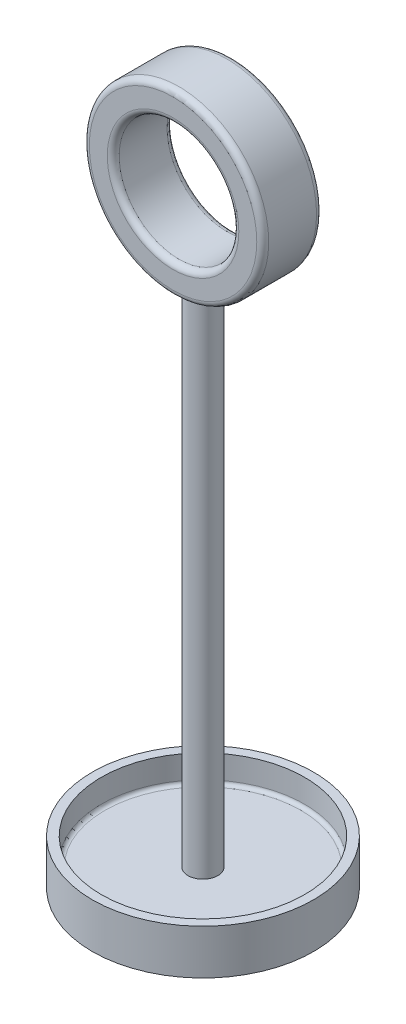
ISO-10303-21;
HEADER;
FILE_DESCRIPTION(('STEP AP214'),'2;1');
FILE_NAME('part.step','',(''),(''),'','','');
FILE_SCHEMA(('AUTOMOTIVE_DESIGN { 1 0 10303 214 1 1 1 1 }'));
ENDSEC;
DATA;
#1=APPLICATION_CONTEXT('core data for automotive mechanical design processes');
#2=APPLICATION_PROTOCOL_DEFINITION('international standard','automotive_design',2000,#1);
#3=PRODUCT_CONTEXT('',#1,'mechanical');
#4=PRODUCT('Part','Part','',(#3));
#5=PRODUCT_RELATED_PRODUCT_CATEGORY('part','',(#4));
#6=PRODUCT_DEFINITION_FORMATION('','',#4);
#7=PRODUCT_DEFINITION_CONTEXT('part definition',#1,'design');
#8=PRODUCT_DEFINITION('design','',#6,#7);
#9=PRODUCT_DEFINITION_SHAPE('','',#8);
#10=(LENGTH_UNIT() NAMED_UNIT(*) SI_UNIT(.MILLI.,.METRE.));
#11=(NAMED_UNIT(*) PLANE_ANGLE_UNIT() SI_UNIT($,.RADIAN.));
#12=(NAMED_UNIT(*) SI_UNIT($,.STERADIAN.) SOLID_ANGLE_UNIT());
#13=UNCERTAINTY_MEASURE_WITH_UNIT(LENGTH_MEASURE(1.E-05),#10,'distance_accuracy_value','');
#14=(GEOMETRIC_REPRESENTATION_CONTEXT(3) GLOBAL_UNCERTAINTY_ASSIGNED_CONTEXT((#13)) GLOBAL_UNIT_ASSIGNED_CONTEXT((#10,
#11,#12)) REPRESENTATION_CONTEXT('',''));
#15=CARTESIAN_POINT('',(0.,0.,0.));
#16=DIRECTION('',(0.,0.,1.));
#17=DIRECTION('',(1.,0.,0.));
#18=AXIS2_PLACEMENT_3D('',#15,#16,#17);
#19=CARTESIAN_POINT('',(0.,0.,-46.99));
#20=DIRECTION('',(0.,0.,1.));
#21=DIRECTION('',(1.,0.,0.));
#22=AXIS2_PLACEMENT_3D('',#19,#20,#21);
#23=CYLINDRICAL_SURFACE('',#22,25.4);
#24=DIRECTION('',(0.,0.,1.));
#25=VECTOR('',#24,1.);
#26=CARTESIAN_POINT('',(-18.2874513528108,17.6275104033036,-46.99));
#27=LINE('',#26,#25);
#28=CARTESIAN_POINT('',(-18.2874513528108,17.6275104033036,-10.16));
#29=VERTEX_POINT('',#28);
#30=CARTESIAN_POINT('',(-18.2874513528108,17.6275104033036,10.16));
#31=VERTEX_POINT('',#30);
#32=EDGE_CURVE('E12',#29,#31,#27,.T.);
#33=ORIENTED_EDGE('',*,*,#32,.F.);
#34=CARTESIAN_POINT('',(0.,0.,-10.16));
#35=DIRECTION('',(0.,0.,1.));
#36=DIRECTION('',(1.,0.,0.));
#37=AXIS2_PLACEMENT_3D('',#34,#35,#36);
#38=CIRCLE('',#37,25.4);
#39=CARTESIAN_POINT('',(18.2874513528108,17.6275104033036,-10.16));
#40=VERTEX_POINT('',#39);
#41=EDGE_CURVE('E71',#29,#40,#38,.F.);
#42=ORIENTED_EDGE('',*,*,#41,.T.);
#43=DIRECTION('',(0.,0.,1.));
#44=VECTOR('',#43,1.);
#45=CARTESIAN_POINT('',(18.2874513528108,17.6275104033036,-46.99));
#46=LINE('',#45,#44);
#47=CARTESIAN_POINT('',(18.2874513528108,17.6275104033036,10.16));
#48=VERTEX_POINT('',#47);
#49=EDGE_CURVE('E52',#48,#40,#46,.F.);
#50=ORIENTED_EDGE('',*,*,#49,.F.);
#51=CARTESIAN_POINT('',(0.,0.,10.16));
#52=DIRECTION('',(0.,0.,1.));
#53=DIRECTION('',(1.,0.,0.));
#54=AXIS2_PLACEMENT_3D('',#51,#52,#53);
#55=CIRCLE('',#54,25.4);
#56=EDGE_CURVE('E69',#48,#31,#55,.T.);
#57=ORIENTED_EDGE('',*,*,#56,.T.);
#58=EDGE_LOOP('',(#33,#42,#50,#57));
#59=FACE_BOUND('',#58,.T.);
#60=ADVANCED_FACE('F43',(#59),#23,.F.);
#61=CARTESIAN_POINT('',(0.,-279.580512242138,0.));
#62=DIRECTION('',(0.,1.,0.));
#63=DIRECTION('',(0.,0.,1.));
#64=AXIS2_PLACEMENT_3D('',#61,#62,#63);
#65=CYLINDRICAL_SURFACE('',#64,6.35);
#66=CARTESIAN_POINT('',(0.,-261.62,0.));
#67=DIRECTION('',(0.,-1.,0.));
#68=DIRECTION('',(0.,0.,-1.));
#69=AXIS2_PLACEMENT_3D('',#66,#67,#68);
#70=CIRCLE('',#69,6.35);
#71=CARTESIAN_POINT('',(0.,-261.62,-6.35));
#72=VERTEX_POINT('',#71);
#73=EDGE_CURVE('E73',#72,#72,#70,.T.);
#74=ORIENTED_EDGE('',*,*,#73,.F.);
#75=EDGE_LOOP('',(#74));
#76=FACE_BOUND('',#75,.T.);
#77=CARTESIAN_POINT('',(-2.13523160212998,-38.0401207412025,8.59329550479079));
#78=CARTESIAN_POINT('',(-1.4957202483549,-38.0760171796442,6.17282122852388));
#79=CARTESIAN_POINT('',(-1.62684312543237,-40.576128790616,6.13806821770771));
#80=CARTESIAN_POINT('',(-1.68408430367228,-38.0654427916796,8.72083930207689));
#81=CARTESIAN_POINT('',(-1.17403905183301,-38.0864461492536,6.25020854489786));
#82=CARTESIAN_POINT('',(-1.28311185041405,-40.603138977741,6.22917093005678));
#83=CARTESIAN_POINT('',(-1.22246188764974,-38.0832294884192,8.80796885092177));
#84=CARTESIAN_POINT('',(-0.851006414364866,-38.0934197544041,6.30155523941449));
#85=CARTESIAN_POINT('',(-0.931399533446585,-40.622111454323,6.29140632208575));
#86=CARTESIAN_POINT('',(-0.291741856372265,-38.1017243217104,8.89851833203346));
#87=CARTESIAN_POINT('',(-0.202020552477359,-38.1006938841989,6.35511063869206));
#88=CARTESIAN_POINT('',(-0.222279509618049,-40.641839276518,6.35608452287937));
#89=CARTESIAN_POINT('',(0.17735483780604,-38.102434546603,8.90194850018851));
#90=CARTESIAN_POINT('',(0.122611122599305,-38.1009655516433,6.3571068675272));
#91=CARTESIAN_POINT('',(0.135127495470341,-40.6425968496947,6.35853464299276));
#92=CARTESIAN_POINT('',(1.10062901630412,-38.0868483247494,8.82571951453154));
#93=CARTESIAN_POINT('',(0.765900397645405,-38.0948456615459,6.31205964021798));
#94=CARTESIAN_POINT('',(0.838574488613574,-40.6259715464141,6.30408536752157));
#95=CARTESIAN_POINT('',(1.55492257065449,-38.0708617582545,8.74757435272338));
#96=CARTESIAN_POINT('',(1.08327757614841,-38.0885996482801,6.2660873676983));
#97=CARTESIAN_POINT('',(1.18470291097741,-40.6089192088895,6.24826739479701));
#98=CARTESIAN_POINT('',(2.44457903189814,-38.0241051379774,8.51303084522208));
#99=CARTESIAN_POINT('',(1.71405910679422,-38.0695133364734,6.12464233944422));
#100=CARTESIAN_POINT('',(1.86253640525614,-40.5590454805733,6.0807363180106));
#101=CARTESIAN_POINT('',(2.87994133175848,-37.9933346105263,8.35662999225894));
#102=CARTESIAN_POINT('',(2.02640546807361,-38.0567417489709,6.02968223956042));
#103=CARTESIAN_POINT('',(2.19424101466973,-40.5262235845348,5.9690214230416));
#104=CARTESIAN_POINT('',(3.7220835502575,-37.920124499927,7.96931227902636));
#105=CARTESIAN_POINT('',(2.64232534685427,-38.0247602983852,5.78748761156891));
#106=CARTESIAN_POINT('',(2.83587318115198,-40.4481327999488,5.69236591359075));
#107=CARTESIAN_POINT('',(4.12870357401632,-37.8776252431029,7.73801327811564));
#108=CARTESIAN_POINT('',(2.94516922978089,-38.0056109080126,5.64072256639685));
#109=CARTESIAN_POINT('',(3.14567891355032,-40.4028002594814,5.52715234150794));
#110=CARTESIAN_POINT('',(4.90022200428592,-37.7855659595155,7.20772364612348));
#111=CARTESIAN_POINT('',(3.53132306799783,-37.9620275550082,5.29413147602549));
#112=CARTESIAN_POINT('',(3.73350247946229,-40.3046036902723,5.14837403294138));
#113=CARTESIAN_POINT('',(5.26511476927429,-37.7360049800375,6.90872387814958));
#114=CARTESIAN_POINT('',(3.81443129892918,-37.9376764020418,5.0950750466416));
#115=CARTESIAN_POINT('',(4.0115160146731,-40.2517386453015,4.93480277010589));
#116=CARTESIAN_POINT('',(5.95088803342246,-37.6340244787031,6.24412814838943));
#117=CARTESIAN_POINT('',(4.35579928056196,-37.8854458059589,4.64097369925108));
#118=CARTESIAN_POINT('',(4.53400993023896,-40.1429594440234,4.46009153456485));
#119=CARTESIAN_POINT('',(6.27068964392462,-37.581566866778,5.87727125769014));
#120=CARTESIAN_POINT('',(4.61377965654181,-37.857535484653,4.38541327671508));
#121=CARTESIAN_POINT('',(4.77766830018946,-40.0870046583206,4.1980508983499));
#122=CARTESIAN_POINT('',(6.84835466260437,-37.480611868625,5.09114869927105));
#123=CARTESIAN_POINT('',(5.08607964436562,-37.8020912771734,3.82607928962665));
#124=CARTESIAN_POINT('',(5.21779402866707,-39.979319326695,3.63653478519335));
#125=CARTESIAN_POINT('',(7.10621535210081,-37.4321146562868,4.67188073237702));
#126=CARTESIAN_POINT('',(5.30109492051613,-37.7745249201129,3.52251692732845));
#127=CARTESIAN_POINT('',(5.41425931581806,-39.9275889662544,3.33705766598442));
#128=CARTESIAN_POINT('',(7.55381614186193,-37.3443755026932,3.7898662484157));
#129=CARTESIAN_POINT('',(5.67746421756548,-37.7236217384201,2.87432718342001));
#130=CARTESIAN_POINT('',(5.75528848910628,-39.8340005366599,2.70704732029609));
#131=CARTESIAN_POINT('',(7.74319036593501,-37.305183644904,3.32690239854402));
#132=CARTESIAN_POINT('',(5.83941099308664,-37.7002155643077,2.52915588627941));
#133=CARTESIAN_POINT('',(5.89957361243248,-39.7921958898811,2.37635885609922));
#134=CARTESIAN_POINT('',(8.04597801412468,-37.2410581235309,2.37247122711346));
#135=CARTESIAN_POINT('',(6.09920172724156,-37.6615366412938,1.81125495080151));
#136=CARTESIAN_POINT('',(6.1302689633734,-39.7237953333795,1.6946223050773));
#137=CARTESIAN_POINT('',(8.15940288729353,-37.2161223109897,1.88100821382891));
#138=CARTESIAN_POINT('',(6.19782695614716,-37.6461566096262,1.43767778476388));
#139=CARTESIAN_POINT('',(6.21668791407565,-39.6971971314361,1.34357729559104));
#140=CARTESIAN_POINT('',(8.30511922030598,-37.1838744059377,0.89372414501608));
#141=CARTESIAN_POINT('',(6.32434369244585,-37.6262594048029,0.684883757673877));
#142=CARTESIAN_POINT('',(6.32770988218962,-39.6627993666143,0.63837438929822));
#143=CARTESIAN_POINT('',(8.33894128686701,-37.176229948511,0.39817239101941));
#144=CARTESIAN_POINT('',(6.35397829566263,-37.6214739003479,0.304766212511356));
#145=CARTESIAN_POINT('',(6.35347907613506,-39.6546452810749,0.284408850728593));
#146=CARTESIAN_POINT('',(8.32881869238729,-37.1784994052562,-0.591953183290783));
#147=CARTESIAN_POINT('',(6.34515813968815,-37.6228836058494,-0.453200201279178));
#148=CARTESIAN_POINT('',(6.34576662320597,-39.6570660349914,-0.422823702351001));
#149=CARTESIAN_POINT('',(8.28488054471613,-37.188411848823,-1.08652708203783));
#150=CARTESIAN_POINT('',(6.30667936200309,-37.6290826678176,-0.832326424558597));
#151=CARTESIAN_POINT('',(6.31228993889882,-39.667639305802,-0.776090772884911));
#152=CARTESIAN_POINT('',(8.12186006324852,-37.224348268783,-2.0535570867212));
#153=CARTESIAN_POINT('',(6.16529913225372,-37.6512094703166,-1.5687562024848));
#154=CARTESIAN_POINT('',(6.1880838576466,-39.7059714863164,-1.46682649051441));
#155=CARTESIAN_POINT('',(8.00382395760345,-37.2501478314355,-2.52622432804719));
#156=CARTESIAN_POINT('',(6.06285035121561,-37.6670700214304,-1.92739477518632));
#157=CARTESIAN_POINT('',(6.0981515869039,-39.7334910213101,-1.80444594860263));
#158=CARTESIAN_POINT('',(7.69723233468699,-37.3147020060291,-3.44368496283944));
#159=CARTESIAN_POINT('',(5.80019918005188,-37.7058932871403,-2.61625695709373));
#160=CARTESIAN_POINT('',(5.86455796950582,-39.8023488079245,-2.45977497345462));
#161=CARTESIAN_POINT('',(7.50867213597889,-37.353457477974,-3.88847650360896));
#162=CARTESIAN_POINT('',(5.63927681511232,-37.7289531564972,-2.94720684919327));
#163=CARTESIAN_POINT('',(5.72089305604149,-39.8436879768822,-2.77748321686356));
#164=CARTESIAN_POINT('',(7.06347740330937,-37.44020844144,-4.74425939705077));
#165=CARTESIAN_POINT('',(5.26546465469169,-37.779139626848,-3.57507096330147));
#166=CARTESIAN_POINT('',(5.38169706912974,-39.9362223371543,-3.3887567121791));
#167=CARTESIAN_POINT('',(6.80595648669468,-37.4883218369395,-5.15471211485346));
#168=CARTESIAN_POINT('',(5.05110760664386,-37.8063971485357,-3.87169541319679));
#169=CARTESIAN_POINT('',(5.18549065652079,-39.9875432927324,-3.68193722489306));
#170=CARTESIAN_POINT('',(6.23109603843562,-37.5881409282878,-5.92438069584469));
#171=CARTESIAN_POINT('',(4.5818025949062,-37.8610564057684,-4.418377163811));
#172=CARTESIAN_POINT('',(4.74750174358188,-40.0940169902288,-4.23170049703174));
#173=CARTESIAN_POINT('',(5.91374057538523,-37.6398475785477,-6.28358286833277));
#174=CARTESIAN_POINT('',(4.32619077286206,-37.8884859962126,-4.66819493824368));
#175=CARTESIAN_POINT('',(4.50570710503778,-40.1491707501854,-4.48827347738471));
#176=CARTESIAN_POINT('',(5.22068309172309,-37.742276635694,-6.94789679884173));
#177=CARTESIAN_POINT('',(3.77962543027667,-37.9408256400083,-5.12155272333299));
#178=CARTESIAN_POINT('',(3.97766330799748,-40.2584284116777,-4.96278342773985));
#179=CARTESIAN_POINT('',(4.84393778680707,-37.7929584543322,-7.2517781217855));
#180=CARTESIAN_POINT('',(3.48783646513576,-37.9656272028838,-5.32337226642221));
#181=CARTESIAN_POINT('',(3.69061926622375,-40.3124890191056,-5.17984151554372));
#182=CARTESIAN_POINT('',(4.04725911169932,-37.8865408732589,-7.78761078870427));
#183=CARTESIAN_POINT('',(2.88399037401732,-38.0097190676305,-5.67265081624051));
#184=CARTESIAN_POINT('',(3.08362598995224,-40.4123102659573,-5.5625791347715));
#185=CARTESIAN_POINT('',(3.62735766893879,-37.9294471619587,-8.01961480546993));
#186=CARTESIAN_POINT('',(2.57219385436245,-38.0289214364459,-5.81930777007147));
#187=CARTESIAN_POINT('',(2.76370108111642,-40.4580769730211,-5.72829628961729));
#188=CARTESIAN_POINT('',(2.84804243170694,-37.9949726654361,-8.36426705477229));
#189=CARTESIAN_POINT('',(2.00439305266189,-38.0573358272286,-6.03386817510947));
#190=CARTESIAN_POINT('',(2.16993709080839,-40.5279708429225,-5.97447646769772));
#191=CARTESIAN_POINT('',(2.49452804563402,-38.0199616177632,-8.4917643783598));
#192=CARTESIAN_POINT('',(1.75051482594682,-38.0677636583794,-6.11156128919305));
#193=CARTESIAN_POINT('',(1.90059279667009,-40.5546257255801,-6.06554598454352));
#194=CARTESIAN_POINT('',(1.77418583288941,-38.0603780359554,-8.69532107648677));
#195=CARTESIAN_POINT('',(1.23846006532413,-38.0843505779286,-6.2346740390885));
#196=CARTESIAN_POINT('',(1.35176063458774,-40.5977365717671,-6.21094362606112));
#197=CARTESIAN_POINT('',(1.40735878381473,-38.075806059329,-8.77138345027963));
#198=CARTESIAN_POINT('',(0.980833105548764,-38.0904709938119,-6.27980384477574));
#199=CARTESIAN_POINT('',(1.07227335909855,-40.6141931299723,-6.26527389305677));
#200=CARTESIAN_POINT('',(0.580991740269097,-38.0982946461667,-8.88190474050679));
#201=CARTESIAN_POINT('',(0.403036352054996,-38.0993726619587,-6.34540443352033));
#202=CARTESIAN_POINT('',(0.442660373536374,-40.6381809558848,-6.34421767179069));
#203=CARTESIAN_POINT('',(0.119698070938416,-38.1025812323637,-8.90260614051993));
#204=CARTESIAN_POINT('',(0.0835434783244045,-38.1010121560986,-6.3574476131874));
#205=CARTESIAN_POINT('',(0.0911985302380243,-40.6427533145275,-6.35900438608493));
#206=CARTESIAN_POINT('',(-0.799804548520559,-38.0943836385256,-8.86258811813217));
#207=CARTESIAN_POINT('',(-0.556156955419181,-38.0978034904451,-6.33383619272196));
#208=CARTESIAN_POINT('',(-0.609374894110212,-40.6340092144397,-6.3304200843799));
#209=CARTESIAN_POINT('',(-1.25801151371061,-38.0818895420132,-8.80182055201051));
#210=CARTESIAN_POINT('',(-0.875077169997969,-38.0929643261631,-6.29824777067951));
#211=CARTESIAN_POINT('',(-0.958484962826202,-40.6206821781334,-6.28701468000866));
#212=CARTESIAN_POINT('',(-2.15777607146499,-38.0415128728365,-8.60085908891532));
#213=CARTESIAN_POINT('',(-1.5097350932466,-38.0766705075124,-6.17778507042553));
#214=CARTESIAN_POINT('',(-1.64401986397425,-40.5776137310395,-6.1434707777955));
#215=CARTESIAN_POINT('',(-2.59934578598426,-38.0136417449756,-8.46072426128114));
#216=CARTESIAN_POINT('',(-1.82434704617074,-38.0652816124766,-6.09339903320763));
#217=CARTESIAN_POINT('',(-1.98045393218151,-40.547884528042,-6.04337447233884));
#218=CARTESIAN_POINT('',(-3.45400452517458,-37.9455377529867,-8.10540841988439));
#219=CARTESIAN_POINT('',(-2.44476217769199,-38.0360080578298,-5.873144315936));
#220=CARTESIAN_POINT('',(-2.63162249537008,-40.4752402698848,-5.78957744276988));
#221=CARTESIAN_POINT('',(-3.8670939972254,-37.9053050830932,-7.89022858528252));
#222=CARTESIAN_POINT('',(-2.74978639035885,-38.0182145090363,-5.73798166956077));
#223=CARTESIAN_POINT('',(-2.94635733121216,-40.4323254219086,-5.63587756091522));
#224=CARTESIAN_POINT('',(-4.65819431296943,-37.8162868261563,-7.38832251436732));
#225=CARTESIAN_POINT('',(-3.34571445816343,-37.9768114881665,-5.41316926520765));
#226=CARTESIAN_POINT('',(-3.54910042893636,-40.3373726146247,-5.27737322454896));
#227=CARTESIAN_POINT('',(-5.03577833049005,-37.767413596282,-7.10084898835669));
#228=CARTESIAN_POINT('',(-3.63614701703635,-37.9532300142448,-5.2237329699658));
#229=CARTESIAN_POINT('',(-3.83678348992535,-40.2852411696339,-5.07203499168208));
#230=CARTESIAN_POINT('',(-5.7409290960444,-37.6666806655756,-6.46343576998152));
#231=CARTESIAN_POINT('',(-4.1885367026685,-37.902443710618,-4.79207999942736));
#232=CARTESIAN_POINT('',(-4.37404121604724,-40.1777927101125,-4.61673983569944));
#233=CARTESIAN_POINT('',(-6.0684893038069,-37.6148205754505,-6.11348792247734));
#234=CARTESIAN_POINT('',(-4.450686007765,-37.8752880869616,-4.55051709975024));
#235=CARTESIAN_POINT('',(-4.62361089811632,-40.1224752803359,-4.36677708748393));
#236=CARTESIAN_POINT('',(-6.67045966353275,-37.5127989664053,-5.35337601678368));
#237=CARTESIAN_POINT('',(-4.93934427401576,-37.8200400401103,-4.01413593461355));
#238=CARTESIAN_POINT('',(-5.08225498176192,-40.0136522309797,-3.82384001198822));
#239=CARTESIAN_POINT('',(-6.94378324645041,-37.4626861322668,-4.9422241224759));
#240=CARTESIAN_POINT('',(-5.16579148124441,-37.7919170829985,-3.71868763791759));
#241=CARTESIAN_POINT('',(-5.29050152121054,-39.9601985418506,-3.53016008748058));
#242=CARTESIAN_POINT('',(-7.42181564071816,-37.3709264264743,-4.07579723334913));
#243=CARTESIAN_POINT('',(-5.5656298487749,-37.7392264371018,-3.08582065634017));
#244=CARTESIAN_POINT('',(-5.65471667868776,-39.8623215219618,-2.91128373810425));
#245=CARTESIAN_POINT('',(-7.62652728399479,-37.329279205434,-3.62052406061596));
#246=CARTESIAN_POINT('',(-5.73988558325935,-37.7145766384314,-2.74819986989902));
#247=CARTESIAN_POINT('',(-5.81068745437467,-39.8178978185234,-2.58608861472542));
#248=CARTESIAN_POINT('',(-7.96009606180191,-37.2595749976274,-2.68133750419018));
#249=CARTESIAN_POINT('',(-6.02507866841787,-37.6728176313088,-2.04463987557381));
#250=CARTESIAN_POINT('',(-6.06483509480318,-39.7435466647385,-1.91524107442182));
#251=CARTESIAN_POINT('',(-8.0893963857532,-37.2314387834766,-2.19761023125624));
#252=CARTESIAN_POINT('',(-6.1371841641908,-37.6555593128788,-1.6781574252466));
#253=CARTESIAN_POINT('',(-6.16334962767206,-39.713534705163,-1.56972159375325));
#254=CARTESIAN_POINT('',(-8.26978748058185,-37.1917908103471,-1.21311039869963));
#255=CARTESIAN_POINT('',(-6.2935075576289,-37.6311842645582,-0.929101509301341));
#256=CARTESIAN_POINT('',(-6.30079046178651,-39.6712435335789,-0.866507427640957));
#257=CARTESIAN_POINT('',(-8.32089097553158,-37.1802763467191,-0.712340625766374));
#258=CARTESIAN_POINT('',(-6.33824862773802,-37.6239877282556,-0.545382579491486));
#259=CARTESIAN_POINT('',(-6.33972645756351,-39.6589614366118,-0.508814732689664));
#260=CARTESIAN_POINT('',(-8.34294117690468,-37.1753333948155,0.280336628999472));
#261=CARTESIAN_POINT('',(-6.35746201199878,-37.6209172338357,0.214484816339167));
#262=CARTESIAN_POINT('',(-6.35652661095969,-39.6536889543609,0.200240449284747));
#263=CARTESIAN_POINT('',(-8.31561142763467,-37.1815160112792,0.772199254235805));
#264=CARTESIAN_POINT('',(-6.33351009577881,-37.6247894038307,0.591869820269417));
#265=CARTESIAN_POINT('',(-6.33570394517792,-39.6602837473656,0.551570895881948));
#266=CARTESIAN_POINT('',(-8.18540171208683,-37.2103959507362,1.74382117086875));
#267=CARTESIAN_POINT('',(-6.22039299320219,-37.6426285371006,1.33321936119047));
#268=CARTESIAN_POINT('',(-6.2364965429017,-39.6910890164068,1.24558655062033));
#269=CARTESIAN_POINT('',(-8.08252247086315,-37.2330931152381,2.22358057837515));
#270=CARTESIAN_POINT('',(-6.13086466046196,-37.6566522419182,1.69833566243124));
#271=CARTESIAN_POINT('',(-6.15811235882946,-39.715299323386,1.58827184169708));
#272=CARTESIAN_POINT('',(-7.80493974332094,-37.2922619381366,3.15603438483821));
#273=CARTESIAN_POINT('',(-5.89228968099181,-37.692459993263,2.40109094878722));
#274=CARTESIAN_POINT('',(-5.94662075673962,-39.7784127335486,2.2543102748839));
#275=CARTESIAN_POINT('',(-7.63047074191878,-37.3286885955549,3.60881166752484));
#276=CARTESIAN_POINT('',(-5.7427567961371,-37.7143140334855,2.73964589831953));
#277=CARTESIAN_POINT('',(-5.81369199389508,-39.8172678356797,2.57772261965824));
#278=CARTESIAN_POINT('',(-7.21486341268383,-37.4112341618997,4.47700576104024));
#279=CARTESIAN_POINT('',(-5.39210241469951,-37.7625188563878,3.38016842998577));
#280=CARTESIAN_POINT('',(-5.49703879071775,-39.9053164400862,3.19786125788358));
#281=CARTESIAN_POINT('',(-6.97371680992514,-37.4573542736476,4.89241792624));
#282=CARTESIAN_POINT('',(-5.19017666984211,-37.7889581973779,3.68249596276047));
#283=CARTESIAN_POINT('',(-5.3133080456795,-39.954511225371,3.49458423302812));
#284=CARTESIAN_POINT('',(-6.42580885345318,-37.5552628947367,5.68319474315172));
#285=CARTESIAN_POINT('',(-4.73980371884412,-37.843292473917,4.24860951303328));
#286=CARTESIAN_POINT('',(-4.89585436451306,-40.0589470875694,4.0594248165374));
#287=CARTESIAN_POINT('',(-6.11781111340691,-37.6071477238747,6.0575713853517));
#288=CARTESIAN_POINT('',(-4.4898163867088,-37.8712433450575,4.51130039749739));
#289=CARTESIAN_POINT('',(-4.66118941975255,-40.1142909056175,4.32683670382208));
#290=CARTESIAN_POINT('',(-5.44753659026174,-37.7100663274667,6.74642617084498));
#291=CARTESIAN_POINT('',(-3.95718338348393,-37.9246524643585,4.98557171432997));
#292=CARTESIAN_POINT('',(-4.15050406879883,-40.2240707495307,4.81887583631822));
#293=CARTESIAN_POINT('',(-5.08525500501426,-37.7611000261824,7.06089900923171));
#294=CARTESIAN_POINT('',(-3.67415630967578,-37.95008403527,5.19658907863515));
#295=CARTESIAN_POINT('',(-3.87448000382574,-40.278506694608,5.04349929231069));
#296=CARTESIAN_POINT('',(-4.31115656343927,-37.8573333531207,7.62484698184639));
#297=CARTESIAN_POINT('',(-3.08225507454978,-37.9962513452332,5.56793317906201));
#298=CARTESIAN_POINT('',(-3.28469071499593,-40.3811555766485,5.44631927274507));
#299=CARTESIAN_POINT('',(-3.89877782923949,-37.9024522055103,7.87346177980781));
#300=CARTESIAN_POINT('',(-2.77326873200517,-38.0168370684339,5.72674765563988));
#301=CARTESIAN_POINT('',(-2.97049739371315,-40.4292823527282,5.62390127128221));
#302=CARTESIAN_POINT('',(-3.03959939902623,-37.9810039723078,8.29300198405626));
#303=CARTESIAN_POINT('',(-2.14181019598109,-38.0515144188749,5.99059357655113));
#304=CARTESIAN_POINT('',(-2.315885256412,-40.5130709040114,5.92357284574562));
#305=CARTESIAN_POINT('',(-2.59280328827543,-38.0144381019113,8.46393546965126));
#306=CARTESIAN_POINT('',(-1.82002300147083,-38.0655032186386,6.09480324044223));
#307=CARTESIAN_POINT('',(-1.97546917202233,-40.5487339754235,6.04566819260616));
#308=CARTESIAN_POINT('',(-2.13523160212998,-38.0401207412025,8.59329550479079));
#309=CARTESIAN_POINT('',(-1.4957202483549,-38.0760171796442,6.17282122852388));
#310=CARTESIAN_POINT('',(-1.62684312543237,-40.576128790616,6.13806821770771));
#311=(BOUNDED_SURFACE() B_SPLINE_SURFACE(3,2,((#77,#78,#79),(#80,#81,#82),(#83,#84,#85),(#86,
#87,#88),(#89,#90,#91),(#92,#93,#94),(#95,#96,#97),(#98,#99,#100),(#101,#102,#103),(#104,#105,
#106),(#107,#108,#109),(#110,#111,#112),(#113,#114,#115),(#116,#117,#118),(#119,#120,#121),
(#122,#123,#124),(#125,#126,#127),(#128,#129,#130),(#131,#132,#133),(#134,#135,#136),(#137,#138,
#139),(#140,#141,#142),(#143,#144,#145),(#146,#147,#148),(#149,#150,#151),(#152,#153,#154),
(#155,#156,#157),(#158,#159,#160),(#161,#162,#163),(#164,#165,#166),(#167,#168,#169),(#170,#171,
#172),(#173,#174,#175),(#176,#177,#178),(#179,#180,#181),(#182,#183,#184),(#185,#186,#187),
(#188,#189,#190),(#191,#192,#193),(#194,#195,#196),(#197,#198,#199),(#200,#201,#202),(#203,#204,
#205),(#206,#207,#208),(#209,#210,#211),(#212,#213,#214),(#215,#216,#217),(#218,#219,#220),
(#221,#222,#223),(#224,#225,#226),(#227,#228,#229),(#230,#231,#232),(#233,#234,#235),(#236,#237,
#238),(#239,#240,#241),(#242,#243,#244),(#245,#246,#247),(#248,#249,#250),(#251,#252,#253),
(#254,#255,#256),(#257,#258,#259),(#260,#261,#262),(#263,#264,#265),(#266,#267,#268),(#269,#270,
#271),(#272,#273,#274),(#275,#276,#277),(#278,#279,#280),(#281,#282,#283),(#284,#285,#286),
(#287,#288,#289),(#290,#291,#292),(#293,#294,#295),(#296,#297,#298),(#299,#300,#301),(#302,#303,
#304),(#305,#306,#307),(#308,#309,#310)),.UNSPECIFIED.,.T.,.F.,
.F.) B_SPLINE_SURFACE_WITH_KNOTS((4,2,2,2,2,2,2,2,2,2,2,2,2,2,2,2,2,2,2,2,2,2,2,2,2,2,2,2,2,2,2,
2,2,2,2,2,2,2,4),(3,3),(0.,1.49388668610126,2.98759067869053,4.45405700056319,5.92057031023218,
7.39468708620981,8.86900292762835,10.3741231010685,11.8793093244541,13.3924219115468,
14.9053063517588,16.3888544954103,17.8722783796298,19.3352140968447,20.7982469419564,
22.2810712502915,23.7642909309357,25.2772821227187,26.7891619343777,27.9824517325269,
29.1756719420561,30.6458981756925,32.1169936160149,33.5869956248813,35.0569745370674,
36.5428223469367,38.0288642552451,39.542197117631,41.0554675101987,42.5597524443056,
44.0637925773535,45.5350366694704,47.0062666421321,48.4727157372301,49.9393469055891,
51.4358500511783,52.9324856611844,54.4478030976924,55.9629628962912),(0.,1.),
.UNSPECIFIED.) GEOMETRIC_REPRESENTATION_ITEM() RATIONAL_B_SPLINE_SURFACE(((1.,0.712164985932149,
1.),(1.,0.710035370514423,1.),(1.,0.708528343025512,1.),(1.,0.706961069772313,1.),(1.,
0.706900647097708,1.),(1.,0.708221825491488,1.),(1.,0.709577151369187,1.),(1.,0.713513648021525,
1.),(1.,0.716094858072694,1.),(1.,0.722179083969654,1.),(1.,0.725686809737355,1.),(1.,
0.733204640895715,1.),(1.,0.737214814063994,1.),(1.,0.745378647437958,1.),(1.,0.749533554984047,
1.),(1.,0.757451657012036,1.),(1.,0.761214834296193,1.),(1.,0.767970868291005,1.),(1.,
0.770959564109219,1.),(1.,0.775826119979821,1.),(1.,0.777704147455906,1.),(1.,0.780129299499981,
1.),(1.,0.78070152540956,1.),(1.,0.780531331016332,1.),(1.,0.779789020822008,1.),(1.,
0.777084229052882,1.),(1.,0.775138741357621,1.),(1.,0.770234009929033,1.),(1.,0.767274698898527,
1.),(1.,0.760587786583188,1.),(1.,0.75685033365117,1.),(1.,0.749014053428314,1.),(1.,
0.744915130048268,1.),(1.,0.736709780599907,1.),(1.,0.73260485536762,1.),(1.,0.724954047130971,
1.),(1.,0.721407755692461,1.),(1.,0.715955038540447,1.),(1.,0.713860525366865,1.),(1.,
0.710461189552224,1.),(1.,0.709156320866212,1.),(1.,0.707252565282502,1.),(1.,0.706887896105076,
1.),(1.,0.707583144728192,1.),(1.,0.708643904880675,1.),(1.,0.712050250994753,1.),(1.,
0.714394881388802,1.),(1.,0.720073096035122,1.),(1.,0.723406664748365,1.),(1.,0.730705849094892,
1.),(1.,0.734677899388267,1.),(1.,0.742776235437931,1.),(1.,0.746902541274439,1.),(1.,
0.754939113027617,1.),(1.,0.758844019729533,1.),(1.,0.765935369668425,1.),(1.,0.769121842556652,
1.),(1.,0.774425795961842,1.),(1.,0.776549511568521,1.),(1.,0.779535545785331,1.),(1.,
0.780398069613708,1.),(1.,0.780768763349,1.),(1.,0.780306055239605,1.),(1.,0.778135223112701,
1.),(1.,0.776427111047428,1.),(1.,0.771942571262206,1.),(1.,0.769169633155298,1.),(1.,
0.762828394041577,1.),(1.,0.759259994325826,1.),(1.,0.751606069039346,1.),(1.,0.747511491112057,
1.),(1.,0.73930222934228,1.),(1.,0.735187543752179,1.),(1.,0.727353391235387,1.),(1.,
0.723639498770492,1.),(1.,0.717125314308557,1.),(1.,0.714324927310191,1.),(1.,0.712164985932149,1.))) REPRESENTATION_ITEM('') SURFACE());
#312=CARTESIAN_POINT('',(-1.62684312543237,-40.576128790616,6.13806821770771));
#313=CARTESIAN_POINT('',(-1.97546917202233,-40.5487339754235,6.04566819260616));
#314=CARTESIAN_POINT('',(-2.315885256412,-40.5130709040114,5.92357284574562));
#315=CARTESIAN_POINT('',(-2.97049739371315,-40.4292823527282,5.62390127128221));
#316=CARTESIAN_POINT('',(-3.28469071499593,-40.3811555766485,5.44631927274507));
#317=CARTESIAN_POINT('',(-3.87448000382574,-40.278506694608,5.04349929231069));
#318=CARTESIAN_POINT('',(-4.15050406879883,-40.2240707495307,4.81887583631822));
#319=CARTESIAN_POINT('',(-4.66118941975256,-40.1142909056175,4.32683670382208));
#320=CARTESIAN_POINT('',(-4.89585436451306,-40.0589470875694,4.0594248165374));
#321=CARTESIAN_POINT('',(-5.3133080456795,-39.954511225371,3.49458423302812));
#322=CARTESIAN_POINT('',(-5.49703879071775,-39.9053164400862,3.19786125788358));
#323=CARTESIAN_POINT('',(-5.81369199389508,-39.8172678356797,2.57772261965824));
#324=CARTESIAN_POINT('',(-5.94662075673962,-39.7784127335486,2.2543102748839));
#325=CARTESIAN_POINT('',(-6.15811235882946,-39.7152993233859,1.58827184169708));
#326=CARTESIAN_POINT('',(-6.2364965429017,-39.6910890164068,1.24558655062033));
#327=CARTESIAN_POINT('',(-6.33570394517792,-39.6602837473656,0.551570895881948));
#328=CARTESIAN_POINT('',(-6.35652661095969,-39.6536889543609,0.200240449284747));
#329=CARTESIAN_POINT('',(-6.33972645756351,-39.6589614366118,-0.508814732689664));
#330=CARTESIAN_POINT('',(-6.30079046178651,-39.6712435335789,-0.866507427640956));
#331=CARTESIAN_POINT('',(-6.16334962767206,-39.713534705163,-1.56972159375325));
#332=CARTESIAN_POINT('',(-6.06483509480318,-39.7435466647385,-1.91524107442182));
#333=CARTESIAN_POINT('',(-5.81068745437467,-39.8178978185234,-2.58608861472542));
#334=CARTESIAN_POINT('',(-5.65471667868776,-39.8623215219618,-2.91128373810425));
#335=CARTESIAN_POINT('',(-5.29050152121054,-39.9601985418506,-3.53016008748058));
#336=CARTESIAN_POINT('',(-5.08225498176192,-40.0136522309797,-3.82384001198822));
#337=CARTESIAN_POINT('',(-4.62361089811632,-40.1224752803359,-4.36677708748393));
#338=CARTESIAN_POINT('',(-4.37404121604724,-40.1777927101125,-4.61673983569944));
#339=CARTESIAN_POINT('',(-3.83678348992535,-40.2852411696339,-5.07203499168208));
#340=CARTESIAN_POINT('',(-3.54910042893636,-40.3373726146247,-5.27737322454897));
#341=CARTESIAN_POINT('',(-2.94635733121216,-40.4323254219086,-5.63587756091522));
#342=CARTESIAN_POINT('',(-2.63162249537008,-40.4752402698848,-5.78957744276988));
#343=CARTESIAN_POINT('',(-1.98045393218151,-40.547884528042,-6.04337447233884));
#344=CARTESIAN_POINT('',(-1.64401986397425,-40.5776137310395,-6.1434707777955));
#345=CARTESIAN_POINT('',(-0.958484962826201,-40.6206821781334,-6.28701468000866));
#346=CARTESIAN_POINT('',(-0.609374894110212,-40.6340092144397,-6.3304200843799));
#347=CARTESIAN_POINT('',(0.0911985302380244,-40.6427533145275,-6.35900438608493));
#348=CARTESIAN_POINT('',(0.442660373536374,-40.6381809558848,-6.34421767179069));
#349=CARTESIAN_POINT('',(1.07227335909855,-40.6141931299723,-6.26527389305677));
#350=CARTESIAN_POINT('',(1.35176063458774,-40.5977365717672,-6.21094362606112));
#351=CARTESIAN_POINT('',(1.90059279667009,-40.5546257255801,-6.06554598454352));
#352=CARTESIAN_POINT('',(2.16993709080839,-40.5279708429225,-5.97447646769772));
#353=CARTESIAN_POINT('',(2.76370108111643,-40.4580769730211,-5.72829628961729));
#354=CARTESIAN_POINT('',(3.08362598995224,-40.4123102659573,-5.5625791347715));
#355=CARTESIAN_POINT('',(3.69061926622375,-40.3124890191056,-5.17984151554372));
#356=CARTESIAN_POINT('',(3.97766330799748,-40.2584284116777,-4.96278342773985));
#357=CARTESIAN_POINT('',(4.50570710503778,-40.1491707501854,-4.48827347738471));
#358=CARTESIAN_POINT('',(4.74750174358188,-40.0940169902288,-4.23170049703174));
#359=CARTESIAN_POINT('',(5.18549065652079,-39.9875432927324,-3.68193722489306));
#360=CARTESIAN_POINT('',(5.38169706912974,-39.9362223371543,-3.3887567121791));
#361=CARTESIAN_POINT('',(5.72089305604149,-39.8436879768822,-2.77748321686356));
#362=CARTESIAN_POINT('',(5.86455796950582,-39.8023488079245,-2.45977497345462));
#363=CARTESIAN_POINT('',(6.0981515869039,-39.7334910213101,-1.80444594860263));
#364=CARTESIAN_POINT('',(6.1880838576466,-39.7059714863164,-1.46682649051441));
#365=CARTESIAN_POINT('',(6.31228993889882,-39.667639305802,-0.776090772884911));
#366=CARTESIAN_POINT('',(6.34576662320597,-39.6570660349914,-0.422823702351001));
#367=CARTESIAN_POINT('',(6.35347907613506,-39.6546452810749,0.284408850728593));
#368=CARTESIAN_POINT('',(6.32770988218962,-39.6627993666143,0.63837438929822));
#369=CARTESIAN_POINT('',(6.21668791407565,-39.6971971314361,1.34357729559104));
#370=CARTESIAN_POINT('',(6.1302689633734,-39.7237953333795,1.6946223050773));
#371=CARTESIAN_POINT('',(5.89957361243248,-39.7921958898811,2.37635885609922));
#372=CARTESIAN_POINT('',(5.75528848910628,-39.8340005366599,2.70704732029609));
#373=CARTESIAN_POINT('',(5.41425931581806,-39.9275889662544,3.33705766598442));
#374=CARTESIAN_POINT('',(5.21779402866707,-39.979319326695,3.63653478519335));
#375=CARTESIAN_POINT('',(4.77766830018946,-40.0870046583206,4.1980508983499));
#376=CARTESIAN_POINT('',(4.53400993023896,-40.1429594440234,4.46009153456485));
#377=CARTESIAN_POINT('',(4.0115160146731,-40.2517386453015,4.93480277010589));
#378=CARTESIAN_POINT('',(3.73350247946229,-40.3046036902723,5.14837403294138));
#379=CARTESIAN_POINT('',(3.14567891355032,-40.4028002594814,5.52715234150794));
#380=CARTESIAN_POINT('',(2.83587318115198,-40.4481327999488,5.69236591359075));
#381=CARTESIAN_POINT('',(2.19424101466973,-40.5262235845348,5.9690214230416));
#382=CARTESIAN_POINT('',(1.86253640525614,-40.5590454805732,6.0807363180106));
#383=CARTESIAN_POINT('',(1.18470291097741,-40.6089192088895,6.24826739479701));
#384=CARTESIAN_POINT('',(0.838574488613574,-40.6259715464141,6.30408536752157));
#385=CARTESIAN_POINT('',(0.135127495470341,-40.6425968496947,6.35853464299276));
#386=CARTESIAN_POINT('',(-0.222279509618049,-40.641839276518,6.35608452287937));
#387=CARTESIAN_POINT('',(-0.931399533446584,-40.622111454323,6.29140632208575));
#388=CARTESIAN_POINT('',(-1.28311185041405,-40.603138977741,6.22917093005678));
#389=CARTESIAN_POINT('',(-1.62684312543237,-40.576128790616,6.13806821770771));
#390=B_SPLINE_CURVE_WITH_KNOTS('',3,(#312,#313,#314,#315,#316,#317,#318,#319,#320,#321,#322,
#323,#324,#325,#326,#327,#328,#329,#330,#331,#332,#333,#334,#335,#336,#337,#338,#339,#340,#341,
#342,#343,#344,#345,#346,#347,#348,#349,#350,#351,#352,#353,#354,#355,#356,#357,#358,#359,#360,
#361,#362,#363,#364,#365,#366,#367,#368,#369,#370,#371,#372,#373,#374,#375,#376,#377,#378,#379,
#380,#381,#382,#383,#384,#385,#386,#387,#388,#389),.UNSPECIFIED.,.T.,.F.,(4,2,2,2,2,2,2,2,2,2,2,
2,2,2,2,2,2,2,2,2,2,2,2,2,2,2,2,2,2,2,2,2,2,2,2,2,2,2,4),(0.,1.51515979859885,3.03047723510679,
4.52711284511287,6.02361599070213,7.49024715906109,8.95669625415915,10.4279262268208,
11.8991703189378,13.4032104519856,14.9074953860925,16.4207657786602,17.9340986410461,
19.4201405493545,20.9059883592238,22.3759672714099,23.8459692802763,25.3170647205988,
26.7872909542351,27.9805111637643,29.1738009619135,30.6856807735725,32.1986719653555,
33.6818916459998,35.1647159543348,36.6277487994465,38.0906845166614,39.574108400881,
41.0576565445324,42.5705409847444,44.0836535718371,45.5888397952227,47.0939599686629,
48.5682758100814,50.042392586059,51.508905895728,52.9753722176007,54.4690762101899,
55.9629628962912),.UNSPECIFIED.);
#391=CARTESIAN_POINT('',(-1.62684312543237,-40.576128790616,6.13806821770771));
#392=VERTEX_POINT('',#391);
#393=EDGE_CURVE('E96',#392,#392,#390,.T.);
#394=ORIENTED_EDGE('',*,*,#393,.T.);
#395=EDGE_LOOP('',(#394));
#396=FACE_BOUND('',#395,.T.);
#397=ADVANCED_FACE('F45',(#76,#396),#65,.T.);
#398=CARTESIAN_POINT('',(0.,-261.62,0.));
#399=DIRECTION('',(0.,-1.,0.));
#400=DIRECTION('',(0.,0.,-1.));
#401=AXIS2_PLACEMENT_3D('',#398,#399,#400);
#402=PLANE('',#401);
#403=CARTESIAN_POINT('',(0.,-261.62,0.));
#404=DIRECTION('',(0.,-1.,0.));
#405=DIRECTION('',(0.,0.,-1.));
#406=AXIS2_PLACEMENT_3D('',#403,#404,#405);
#407=CIRCLE('',#406,12.7);
#408=CARTESIAN_POINT('',(0.,-261.62,-12.7));
#409=VERTEX_POINT('',#408);
#410=EDGE_CURVE('E305',#409,#409,#407,.T.);
#411=ORIENTED_EDGE('',*,*,#410,.F.);
#412=EDGE_LOOP('',(#411));
#413=FACE_BOUND('',#412,.T.);
#414=ORIENTED_EDGE('',*,*,#73,.T.);
#415=EDGE_LOOP('',(#414));
#416=FACE_BOUND('',#415,.T.);
#417=ADVANCED_FACE('F136',(#413,#416),#402,.F.);
#418=CARTESIAN_POINT('',(0.,-267.97,0.));
#419=DIRECTION('',(0.,1.,0.));
#420=DIRECTION('',(0.,0.,1.));
#421=AXIS2_PLACEMENT_3D('',#418,#419,#420);
#422=CYLINDRICAL_SURFACE('',#421,12.7);
#423=CARTESIAN_POINT('',(0.,-267.97,0.));
#424=DIRECTION('',(0.,-1.,0.));
#425=DIRECTION('',(0.,0.,-1.));
#426=AXIS2_PLACEMENT_3D('',#423,#424,#425);
#427=CIRCLE('',#426,12.7);
#428=CARTESIAN_POINT('',(0.,-267.97,-12.7));
#429=VERTEX_POINT('',#428);
#430=EDGE_CURVE('E127',#429,#429,#427,.T.);
#431=ORIENTED_EDGE('',*,*,#430,.F.);
#432=EDGE_LOOP('',(#431));
#433=FACE_BOUND('',#432,.T.);
#434=ORIENTED_EDGE('',*,*,#410,.T.);
#435=EDGE_LOOP('',(#434));
#436=FACE_BOUND('',#435,.T.);
#437=ADVANCED_FACE('F134',(#433,#436),#422,.T.);
#438=CARTESIAN_POINT('',(0.,-267.97,0.));
#439=DIRECTION('',(0.,-1.,0.));
#440=DIRECTION('',(0.,0.,-1.));
#441=AXIS2_PLACEMENT_3D('',#438,#439,#440);
#442=PLANE('',#441);
#443=ORIENTED_EDGE('',*,*,#430,.T.);
#444=EDGE_LOOP('',(#443));
#445=FACE_BOUND('',#444,.T.);
#446=ADVANCED_FACE('F131',(#445),#442,.T.);
#447=CARTESIAN_POINT('',(0.,0.,12.7));
#448=DIRECTION('',(0.,0.,-1.));
#449=DIRECTION('',(-1.,0.,0.));
#450=AXIS2_PLACEMENT_3D('',#447,#448,#449);
#451=CYLINDRICAL_SURFACE('',#450,38.1);
#452=CARTESIAN_POINT('',(-2.13523160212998,-38.0401207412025,8.59329550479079));
#453=CARTESIAN_POINT('',(-1.68408430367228,-38.0654427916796,8.72083930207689));
#454=CARTESIAN_POINT('',(-1.22246188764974,-38.0832294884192,8.80796885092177));
#455=CARTESIAN_POINT('',(-0.291741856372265,-38.1017243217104,8.89851833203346));
#456=CARTESIAN_POINT('',(0.17735483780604,-38.102434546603,8.90194850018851));
#457=CARTESIAN_POINT('',(1.10062901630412,-38.0868483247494,8.82571951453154));
#458=CARTESIAN_POINT('',(1.55492257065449,-38.0708617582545,8.74757435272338));
#459=CARTESIAN_POINT('',(2.44457903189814,-38.0241051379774,8.51303084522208));
#460=CARTESIAN_POINT('',(2.87994133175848,-37.9933346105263,8.35662999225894));
#461=CARTESIAN_POINT('',(3.7220835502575,-37.920124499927,7.96931227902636));
#462=CARTESIAN_POINT('',(4.12870357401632,-37.8776252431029,7.73801327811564));
#463=CARTESIAN_POINT('',(4.90022200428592,-37.7855659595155,7.20772364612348));
#464=CARTESIAN_POINT('',(5.26511476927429,-37.7360049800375,6.90872387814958));
#465=CARTESIAN_POINT('',(5.95088803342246,-37.6340244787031,6.24412814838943));
#466=CARTESIAN_POINT('',(6.27068964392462,-37.581566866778,5.87727125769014));
#467=CARTESIAN_POINT('',(6.84835466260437,-37.480611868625,5.09114869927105));
#468=CARTESIAN_POINT('',(7.10621535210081,-37.4321146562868,4.67188073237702));
#469=CARTESIAN_POINT('',(7.55381614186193,-37.3443755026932,3.7898662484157));
#470=CARTESIAN_POINT('',(7.74319036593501,-37.305183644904,3.32690239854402));
#471=CARTESIAN_POINT('',(8.04597801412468,-37.2410581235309,2.37247122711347));
#472=CARTESIAN_POINT('',(8.15940288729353,-37.2161223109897,1.88100821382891));
#473=CARTESIAN_POINT('',(8.30511922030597,-37.1838744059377,0.893724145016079));
#474=CARTESIAN_POINT('',(8.33894128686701,-37.176229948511,0.398172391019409));
#475=CARTESIAN_POINT('',(8.32881869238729,-37.1784994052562,-0.591953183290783));
#476=CARTESIAN_POINT('',(8.28488054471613,-37.188411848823,-1.08652708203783));
#477=CARTESIAN_POINT('',(8.12186006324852,-37.224348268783,-2.0535570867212));
#478=CARTESIAN_POINT('',(8.00382395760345,-37.2501478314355,-2.5262243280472));
#479=CARTESIAN_POINT('',(7.69723233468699,-37.3147020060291,-3.44368496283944));
#480=CARTESIAN_POINT('',(7.50867213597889,-37.353457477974,-3.88847650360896));
#481=CARTESIAN_POINT('',(7.06347740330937,-37.44020844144,-4.74425939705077));
#482=CARTESIAN_POINT('',(6.80595648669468,-37.4883218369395,-5.15471211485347));
#483=CARTESIAN_POINT('',(6.23109603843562,-37.5881409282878,-5.92438069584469));
#484=CARTESIAN_POINT('',(5.91374057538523,-37.6398475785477,-6.28358286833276));
#485=CARTESIAN_POINT('',(5.22068309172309,-37.742276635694,-6.94789679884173));
#486=CARTESIAN_POINT('',(4.84393778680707,-37.7929584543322,-7.2517781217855));
#487=CARTESIAN_POINT('',(4.04725911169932,-37.8865408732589,-7.78761078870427));
#488=CARTESIAN_POINT('',(3.62735766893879,-37.9294471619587,-8.01961480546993));
#489=CARTESIAN_POINT('',(2.84804243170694,-37.9949726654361,-8.36426705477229));
#490=CARTESIAN_POINT('',(2.49452804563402,-38.0199616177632,-8.4917643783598));
#491=CARTESIAN_POINT('',(1.7741858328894,-38.0603780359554,-8.69532107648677));
#492=CARTESIAN_POINT('',(1.40735878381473,-38.075806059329,-8.77138345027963));
#493=CARTESIAN_POINT('',(0.580991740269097,-38.0982946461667,-8.88190474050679));
#494=CARTESIAN_POINT('',(0.119698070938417,-38.1025812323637,-8.90260614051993));
#495=CARTESIAN_POINT('',(-0.799804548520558,-38.0943836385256,-8.86258811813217));
#496=CARTESIAN_POINT('',(-1.25801151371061,-38.0818895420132,-8.80182055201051));
#497=CARTESIAN_POINT('',(-2.15777607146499,-38.0415128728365,-8.60085908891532));
#498=CARTESIAN_POINT('',(-2.59934578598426,-38.0136417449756,-8.46072426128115));
#499=CARTESIAN_POINT('',(-3.45400452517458,-37.9455377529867,-8.10540841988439));
#500=CARTESIAN_POINT('',(-3.8670939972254,-37.9053050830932,-7.89022858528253));
#501=CARTESIAN_POINT('',(-4.65819431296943,-37.8162868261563,-7.38832251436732));
#502=CARTESIAN_POINT('',(-5.03577833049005,-37.767413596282,-7.10084898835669));
#503=CARTESIAN_POINT('',(-5.7409290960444,-37.6666806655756,-6.46343576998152));
#504=CARTESIAN_POINT('',(-6.0684893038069,-37.6148205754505,-6.11348792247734));
#505=CARTESIAN_POINT('',(-6.67045966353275,-37.5127989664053,-5.35337601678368));
#506=CARTESIAN_POINT('',(-6.94378324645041,-37.4626861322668,-4.9422241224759));
#507=CARTESIAN_POINT('',(-7.42181564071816,-37.3709264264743,-4.07579723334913));
#508=CARTESIAN_POINT('',(-7.62652728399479,-37.329279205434,-3.62052406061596));
#509=CARTESIAN_POINT('',(-7.96009606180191,-37.2595749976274,-2.68133750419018));
#510=CARTESIAN_POINT('',(-8.0893963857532,-37.2314387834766,-2.19761023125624));
#511=CARTESIAN_POINT('',(-8.26978748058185,-37.1917908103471,-1.21311039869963));
#512=CARTESIAN_POINT('',(-8.32089097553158,-37.1802763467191,-0.712340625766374));
#513=CARTESIAN_POINT('',(-8.34294117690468,-37.1753333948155,0.280336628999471));
#514=CARTESIAN_POINT('',(-8.31561142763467,-37.1815160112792,0.772199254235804));
#515=CARTESIAN_POINT('',(-8.18540171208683,-37.2103959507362,1.74382117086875));
#516=CARTESIAN_POINT('',(-8.08252247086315,-37.2330931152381,2.22358057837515));
#517=CARTESIAN_POINT('',(-7.80493974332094,-37.2922619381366,3.15603438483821));
#518=CARTESIAN_POINT('',(-7.63047074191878,-37.3286885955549,3.60881166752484));
#519=CARTESIAN_POINT('',(-7.21486341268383,-37.4112341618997,4.47700576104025));
#520=CARTESIAN_POINT('',(-6.97371680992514,-37.4573542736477,4.89241792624));
#521=CARTESIAN_POINT('',(-6.42580885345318,-37.5552628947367,5.68319474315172));
#522=CARTESIAN_POINT('',(-6.11781111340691,-37.6071477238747,6.0575713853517));
#523=CARTESIAN_POINT('',(-5.44753659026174,-37.7100663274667,6.74642617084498));
#524=CARTESIAN_POINT('',(-5.08525500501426,-37.7611000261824,7.06089900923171));
#525=CARTESIAN_POINT('',(-4.31115656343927,-37.8573333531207,7.62484698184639));
#526=CARTESIAN_POINT('',(-3.89877782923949,-37.9024522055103,7.87346177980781));
#527=CARTESIAN_POINT('',(-3.03959939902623,-37.9810039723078,8.29300198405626));
#528=CARTESIAN_POINT('',(-2.59280328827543,-38.0144381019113,8.46393546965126));
#529=CARTESIAN_POINT('',(-2.13523160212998,-38.0401207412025,8.59329550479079));
#530=B_SPLINE_CURVE_WITH_KNOTS('',3,(#452,#453,#454,#455,#456,#457,#458,#459,#460,#461,#462,
#463,#464,#465,#466,#467,#468,#469,#470,#471,#472,#473,#474,#475,#476,#477,#478,#479,#480,#481,
#482,#483,#484,#485,#486,#487,#488,#489,#490,#491,#492,#493,#494,#495,#496,#497,#498,#499,#500,
#501,#502,#503,#504,#505,#506,#507,#508,#509,#510,#511,#512,#513,#514,#515,#516,#517,#518,#519,
#520,#521,#522,#523,#524,#525,#526,#527,#528,#529),.UNSPECIFIED.,.T.,.F.,(4,2,2,2,2,2,2,2,2,2,2,
2,2,2,2,2,2,2,2,2,2,2,2,2,2,2,2,2,2,2,2,2,2,2,2,2,2,2,4),(0.,1.49388668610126,2.98759067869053,
4.45405700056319,5.92057031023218,7.39468708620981,8.86900292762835,10.3741231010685,
11.8793093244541,13.3924219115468,14.9053063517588,16.3888544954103,17.8722783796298,
19.3352140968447,20.7982469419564,22.2810712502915,23.7642909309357,25.2772821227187,
26.7891619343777,27.9824517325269,29.1756719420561,30.6458981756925,32.1169936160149,
33.5869956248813,35.0569745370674,36.5428223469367,38.0288642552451,39.542197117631,
41.0554675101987,42.5597524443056,44.0637925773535,45.5350366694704,47.0062666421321,
48.4727157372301,49.9393469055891,51.4358500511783,52.9324856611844,54.4478030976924,
55.9629628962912),.UNSPECIFIED.);
#531=CARTESIAN_POINT('',(-2.13523160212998,-38.0401207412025,8.59329550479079));
#532=VERTEX_POINT('',#531);
#533=EDGE_CURVE('E89',#532,#532,#530,.T.);
#534=ORIENTED_EDGE('',*,*,#533,.T.);
#535=EDGE_LOOP('',(#534));
#536=FACE_BOUND('',#535,.T.);
#537=CARTESIAN_POINT('',(0.,0.,10.16));
#538=DIRECTION('',(0.,0.,1.));
#539=DIRECTION('',(1.,0.,0.));
#540=AXIS2_PLACEMENT_3D('',#537,#538,#539);
#541=CIRCLE('',#540,38.1);
#542=CARTESIAN_POINT('',(38.1,0.,10.16));
#543=VERTEX_POINT('',#542);
#544=EDGE_CURVE('E176',#543,#543,#541,.F.);
#545=ORIENTED_EDGE('',*,*,#544,.T.);
#546=EDGE_LOOP('',(#545));
#547=FACE_BOUND('',#546,.T.);
#548=CARTESIAN_POINT('',(0.,0.,-10.16));
#549=DIRECTION('',(0.,0.,1.));
#550=DIRECTION('',(1.,0.,0.));
#551=AXIS2_PLACEMENT_3D('',#548,#549,#550);
#552=CIRCLE('',#551,38.1);
#553=CARTESIAN_POINT('',(38.1,0.,-10.16));
#554=VERTEX_POINT('',#553);
#555=EDGE_CURVE('E178',#554,#554,#552,.T.);
#556=ORIENTED_EDGE('',*,*,#555,.T.);
#557=EDGE_LOOP('',(#556));
#558=FACE_BOUND('',#557,.T.);
#559=ADVANCED_FACE('F102',(#536,#547,#558),#451,.T.);
#560=CARTESIAN_POINT('',(0.,0.,12.7));
#561=DIRECTION('',(0.,0.,1.));
#562=DIRECTION('',(1.,0.,0.));
#563=AXIS2_PLACEMENT_3D('',#560,#561,#562);
#564=PLANE('',#563);
#565=CARTESIAN_POINT('',(0.,0.,12.7));
#566=DIRECTION('',(0.,0.,1.));
#567=DIRECTION('',(1.,0.,0.));
#568=AXIS2_PLACEMENT_3D('',#565,#566,#567);
#569=CIRCLE('',#568,35.56);
#570=CARTESIAN_POINT('',(35.56,0.,12.7));
#571=VERTEX_POINT('',#570);
#572=EDGE_CURVE('E182',#571,#571,#569,.T.);
#573=ORIENTED_EDGE('',*,*,#572,.T.);
#574=EDGE_LOOP('',(#573));
#575=FACE_BOUND('',#574,.T.);
#576=CARTESIAN_POINT('',(0.,0.,12.7));
#577=DIRECTION('',(0.,0.,1.));
#578=DIRECTION('',(1.,0.,0.));
#579=AXIS2_PLACEMENT_3D('',#576,#577,#578);
#580=CIRCLE('',#579,27.94);
#581=CARTESIAN_POINT('',(27.94,0.,12.7));
#582=VERTEX_POINT('',#581);
#583=EDGE_CURVE('E187',#582,#582,#580,.F.);
#584=ORIENTED_EDGE('',*,*,#583,.T.);
#585=EDGE_LOOP('',(#584));
#586=FACE_BOUND('',#585,.T.);
#587=ADVANCED_FACE('F158',(#575,#586),#564,.T.);
#588=CARTESIAN_POINT('',(0.,0.,-12.7));
#589=DIRECTION('',(0.,0.,1.));
#590=DIRECTION('',(1.,0.,0.));
#591=AXIS2_PLACEMENT_3D('',#588,#589,#590);
#592=PLANE('',#591);
#593=CARTESIAN_POINT('',(0.,0.,-12.7));
#594=DIRECTION('',(0.,0.,1.));
#595=DIRECTION('',(1.,0.,0.));
#596=AXIS2_PLACEMENT_3D('',#593,#594,#595);
#597=CIRCLE('',#596,35.56);
#598=CARTESIAN_POINT('',(35.56,0.,-12.7));
#599=VERTEX_POINT('',#598);
#600=EDGE_CURVE('E82',#599,#599,#597,.F.);
#601=ORIENTED_EDGE('',*,*,#600,.T.);
#602=EDGE_LOOP('',(#601));
#603=FACE_BOUND('',#602,.T.);
#604=CARTESIAN_POINT('',(0.,0.,-12.7));
#605=DIRECTION('',(0.,0.,1.));
#606=DIRECTION('',(1.,0.,0.));
#607=AXIS2_PLACEMENT_3D('',#604,#605,#606);
#608=CIRCLE('',#607,27.94);
#609=CARTESIAN_POINT('',(27.94,0.,-12.7));
#610=VERTEX_POINT('',#609);
#611=EDGE_CURVE('E80',#610,#610,#608,.T.);
#612=ORIENTED_EDGE('',*,*,#611,.T.);
#613=EDGE_LOOP('',(#612));
#614=FACE_BOUND('',#613,.T.);
#615=ADVANCED_FACE('F152',(#603,#614),#592,.F.);
#616=EDGE_CURVE('E175',#40,#29,#38,.F.);
#617=ORIENTED_EDGE('',*,*,#616,.T.);
#618=ORIENTED_EDGE('',*,*,#32,.T.);
#619=EDGE_CURVE('E75',#31,#48,#55,.T.);
#620=ORIENTED_EDGE('',*,*,#619,.T.);
#621=ORIENTED_EDGE('',*,*,#49,.T.);
#622=EDGE_LOOP('',(#617,#618,#620,#621));
#623=FACE_BOUND('',#622,.T.);
#624=ADVANCED_FACE('F76',(#623),#23,.F.);
#625=CARTESIAN_POINT('',(0.,0.,10.16));
#626=DIRECTION('',(0.,0.,1.));
#627=DIRECTION('',(1.,0.,0.));
#628=AXIS2_PLACEMENT_3D('',#625,#626,#627);
#629=TOROIDAL_SURFACE('',#628,35.56,2.54);
#630=ORIENTED_EDGE('',*,*,#544,.F.);
#631=EDGE_LOOP('',(#630));
#632=FACE_BOUND('',#631,.T.);
#633=ORIENTED_EDGE('',*,*,#572,.F.);
#634=EDGE_LOOP('',(#633));
#635=FACE_BOUND('',#634,.T.);
#636=ADVANCED_FACE('F151',(#632,#635),#629,.T.);
#637=CARTESIAN_POINT('',(0.,0.,10.16));
#638=DIRECTION('',(0.,0.,1.));
#639=DIRECTION('',(1.,0.,0.));
#640=AXIS2_PLACEMENT_3D('',#637,#638,#639);
#641=TOROIDAL_SURFACE('',#640,27.94,2.54);
#642=ORIENTED_EDGE('',*,*,#583,.F.);
#643=EDGE_LOOP('',(#642));
#644=FACE_BOUND('',#643,.T.);
#645=ORIENTED_EDGE('',*,*,#56,.F.);
#646=ORIENTED_EDGE('',*,*,#619,.F.);
#647=EDGE_LOOP('',(#645,#646));
#648=FACE_BOUND('',#647,.T.);
#649=ADVANCED_FACE('F79',(#644,#648),#641,.T.);
#650=CARTESIAN_POINT('',(0.,0.,-10.16));
#651=DIRECTION('',(0.,0.,1.));
#652=DIRECTION('',(1.,0.,0.));
#653=AXIS2_PLACEMENT_3D('',#650,#651,#652);
#654=TOROIDAL_SURFACE('',#653,35.56,2.54);
#655=ORIENTED_EDGE('',*,*,#600,.F.);
#656=EDGE_LOOP('',(#655));
#657=FACE_BOUND('',#656,.T.);
#658=ORIENTED_EDGE('',*,*,#555,.F.);
#659=EDGE_LOOP('',(#658));
#660=FACE_BOUND('',#659,.T.);
#661=ADVANCED_FACE('F169',(#657,#660),#654,.T.);
#662=CARTESIAN_POINT('',(0.,0.,-10.16));
#663=DIRECTION('',(0.,0.,1.));
#664=DIRECTION('',(1.,0.,0.));
#665=AXIS2_PLACEMENT_3D('',#662,#663,#664);
#666=TOROIDAL_SURFACE('',#665,27.94,2.54);
#667=ORIENTED_EDGE('',*,*,#41,.F.);
#668=ORIENTED_EDGE('',*,*,#616,.F.);
#669=EDGE_LOOP('',(#667,#668));
#670=FACE_BOUND('',#669,.T.);
#671=ORIENTED_EDGE('',*,*,#611,.F.);
#672=EDGE_LOOP('',(#671));
#673=FACE_BOUND('',#672,.T.);
#674=ADVANCED_FACE('F109',(#670,#673),#666,.T.);
#675=CARTESIAN_POINT('',(-2.27758037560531,-40.576128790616,8.59329550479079));
#676=DIRECTION('',(0.965205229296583,-0.0541779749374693,0.255819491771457));
#677=DIRECTION('',(0.256195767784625,0.,-0.966624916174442));
#678=AXIS2_PLACEMENT_3D('',#675,#676,#677);
#679=CIRCLE('',#678,2.54);
#680=EDGE_CURVE('',#392,#532,#679,.T.);
#681=ORIENTED_EDGE('',*,*,#393,.F.);
#682=ORIENTED_EDGE('',*,*,#533,.F.);
#683=ORIENTED_EDGE('',*,*,#680,.T.);
#684=ORIENTED_EDGE('',*,*,#680,.F.);
#685=EDGE_LOOP('',(#681,#683,#682,#684));
#686=FACE_BOUND('',#685,.T.);
#687=ADVANCED_FACE('F112',(#686),#311,.F.);
#688=CLOSED_SHELL('',(#60,#397,#417,#437,#446,#559,#587,#615,#624,#636,#649,#661,#674,#687));
#689=MANIFOLD_SOLID_BREP('B2',#688);
#690=CARTESIAN_POINT('',(0.,-242.57,46.99));
#691=DIRECTION('',(0.,1.,0.));
#692=DIRECTION('',(0.,0.,1.));
#693=AXIS2_PLACEMENT_3D('',#690,#691,#692);
#694=PLANE('',#693);
#695=CARTESIAN_POINT('',(0.,-242.57,0.));
#696=DIRECTION('',(0.,1.,0.));
#697=DIRECTION('',(0.,0.,1.));
#698=AXIS2_PLACEMENT_3D('',#695,#696,#697);
#699=CIRCLE('',#698,46.99);
#700=CARTESIAN_POINT('',(0.,-242.57,46.99));
#701=VERTEX_POINT('',#700);
#702=EDGE_CURVE('E331',#701,#701,#699,.T.);
#703=ORIENTED_EDGE('',*,*,#702,.T.);
#704=EDGE_LOOP('',(#703));
#705=FACE_BOUND('',#704,.T.);
#706=CARTESIAN_POINT('',(0.,-242.57,0.));
#707=DIRECTION('',(0.,1.,0.));
#708=DIRECTION('',(0.,0.,1.));
#709=AXIS2_PLACEMENT_3D('',#706,#707,#708);
#710=CIRCLE('',#709,43.18);
#711=CARTESIAN_POINT('',(0.,-242.57,43.18));
#712=VERTEX_POINT('',#711);
#713=EDGE_CURVE('E340',#712,#712,#710,.T.);
#714=ORIENTED_EDGE('',*,*,#713,.F.);
#715=EDGE_LOOP('',(#714));
#716=FACE_BOUND('',#715,.T.);
#717=ADVANCED_FACE('F320',(#705,#716),#694,.T.);
#718=CARTESIAN_POINT('',(0.,-177.235139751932,0.));
#719=DIRECTION('',(0.,1.,0.));
#720=DIRECTION('',(0.,0.,1.));
#721=AXIS2_PLACEMENT_3D('',#718,#719,#720);
#722=CYLINDRICAL_SURFACE('',#721,46.99);
#723=CARTESIAN_POINT('',(0.,-261.62,0.));
#724=DIRECTION('',(0.,1.,0.));
#725=DIRECTION('',(0.,0.,1.));
#726=AXIS2_PLACEMENT_3D('',#723,#724,#725);
#727=CIRCLE('',#726,46.99);
#728=CARTESIAN_POINT('',(0.,-261.62,46.99));
#729=VERTEX_POINT('',#728);
#730=EDGE_CURVE('E335',#729,#729,#727,.T.);
#731=ORIENTED_EDGE('',*,*,#730,.T.);
#732=EDGE_LOOP('',(#731));
#733=FACE_BOUND('',#732,.T.);
#734=ORIENTED_EDGE('',*,*,#702,.F.);
#735=EDGE_LOOP('',(#734));
#736=FACE_BOUND('',#735,.T.);
#737=ADVANCED_FACE('F368',(#733,#736),#722,.T.);
#738=CARTESIAN_POINT('',(0.,-261.62,0.));
#739=DIRECTION('',(0.,-1.,0.));
#740=DIRECTION('',(0.,0.,-1.));
#741=AXIS2_PLACEMENT_3D('',#738,#739,#740);
#742=PLANE('',#741);
#743=CARTESIAN_POINT('',(0.,-261.62,0.));
#744=DIRECTION('',(0.,1.,0.));
#745=DIRECTION('',(0.,0.,1.));
#746=AXIS2_PLACEMENT_3D('',#743,#744,#745);
#747=CIRCLE('',#746,6.35);
#748=CARTESIAN_POINT('',(0.,-261.62,6.35));
#749=VERTEX_POINT('',#748);
#750=EDGE_CURVE('E343',#749,#749,#747,.T.);
#751=ORIENTED_EDGE('',*,*,#750,.T.);
#752=EDGE_LOOP('',(#751));
#753=FACE_BOUND('',#752,.T.);
#754=ORIENTED_EDGE('',*,*,#730,.F.);
#755=EDGE_LOOP('',(#754));
#756=FACE_BOUND('',#755,.T.);
#757=ADVANCED_FACE('F350',(#753,#756),#742,.T.);
#758=CARTESIAN_POINT('',(0.,-254.,43.18));
#759=DIRECTION('',(0.,1.,0.));
#760=DIRECTION('',(0.,0.,1.));
#761=AXIS2_PLACEMENT_3D('',#758,#759,#760);
#762=PLANE('',#761);
#763=CARTESIAN_POINT('',(0.,-254.,0.));
#764=DIRECTION('',(0.,1.,0.));
#765=DIRECTION('',(0.,0.,1.));
#766=AXIS2_PLACEMENT_3D('',#763,#764,#765);
#767=CIRCLE('',#766,6.35);
#768=CARTESIAN_POINT('',(0.,-254.,6.35));
#769=VERTEX_POINT('',#768);
#770=EDGE_CURVE('E344',#769,#769,#767,.T.);
#771=ORIENTED_EDGE('',*,*,#770,.F.);
#772=EDGE_LOOP('',(#771));
#773=FACE_BOUND('',#772,.T.);
#774=CARTESIAN_POINT('',(0.,-254.,0.));
#775=DIRECTION('',(0.,1.,0.));
#776=DIRECTION('',(0.,0.,1.));
#777=AXIS2_PLACEMENT_3D('',#774,#775,#776);
#778=CIRCLE('',#777,41.656);
#779=CARTESIAN_POINT('',(0.,-254.,41.656));
#780=VERTEX_POINT('',#779);
#781=EDGE_CURVE('E327',#780,#780,#778,.T.);
#782=ORIENTED_EDGE('',*,*,#781,.T.);
#783=EDGE_LOOP('',(#782));
#784=FACE_BOUND('',#783,.T.);
#785=ADVANCED_FACE('F359',(#773,#784),#762,.T.);
#786=CARTESIAN_POINT('',(0.,-177.235139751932,0.));
#787=DIRECTION('',(0.,1.,0.));
#788=DIRECTION('',(0.,0.,1.));
#789=AXIS2_PLACEMENT_3D('',#786,#787,#788);
#790=CYLINDRICAL_SURFACE('',#789,43.18);
#791=CARTESIAN_POINT('',(0.,-252.476,0.));
#792=DIRECTION('',(0.,1.,0.));
#793=DIRECTION('',(0.,0.,1.));
#794=AXIS2_PLACEMENT_3D('',#791,#792,#793);
#795=CIRCLE('',#794,43.18);
#796=CARTESIAN_POINT('',(0.,-252.476,43.18));
#797=VERTEX_POINT('',#796);
#798=EDGE_CURVE('E42',#797,#797,#795,.F.);
#799=ORIENTED_EDGE('',*,*,#798,.T.);
#800=EDGE_LOOP('',(#799));
#801=FACE_BOUND('',#800,.T.);
#802=ORIENTED_EDGE('',*,*,#713,.T.);
#803=EDGE_LOOP('',(#802));
#804=FACE_BOUND('',#803,.T.);
#805=ADVANCED_FACE('F361',(#801,#804),#790,.F.);
#806=CARTESIAN_POINT('',(0.,-252.476,0.));
#807=DIRECTION('',(0.,1.,0.));
#808=DIRECTION('',(0.,0.,1.));
#809=AXIS2_PLACEMENT_3D('',#806,#807,#808);
#810=TOROIDAL_SURFACE('',#809,41.656,1.524);
#811=ORIENTED_EDGE('',*,*,#798,.F.);
#812=EDGE_LOOP('',(#811));
#813=FACE_BOUND('',#812,.T.);
#814=ORIENTED_EDGE('',*,*,#781,.F.);
#815=EDGE_LOOP('',(#814));
#816=FACE_BOUND('',#815,.T.);
#817=ADVANCED_FACE('F322',(#813,#816),#810,.F.);
#818=CARTESIAN_POINT('',(0.,-261.62,0.));
#819=DIRECTION('',(0.,1.,0.));
#820=DIRECTION('',(0.,0.,1.));
#821=AXIS2_PLACEMENT_3D('',#818,#819,#820);
#822=CYLINDRICAL_SURFACE('',#821,6.35);
#823=CARTESIAN_POINT('',(0.,-261.62,6.35));
#824=CARTESIAN_POINT('',(0.,-261.540625,6.35));
#825=CARTESIAN_POINT('',(0.,-261.46125,6.35));
#826=CARTESIAN_POINT('',(0.,-261.3025,6.35));
#827=CARTESIAN_POINT('',(0.,-261.223125,6.35));
#828=CARTESIAN_POINT('',(0.,-261.064375,6.35));
#829=CARTESIAN_POINT('',(0.,-260.985,6.35));
#830=CARTESIAN_POINT('',(0.,-260.82625,6.35));
#831=CARTESIAN_POINT('',(0.,-260.746875,6.35));
#832=CARTESIAN_POINT('',(0.,-260.588125,6.35));
#833=CARTESIAN_POINT('',(0.,-260.50875,6.35));
#834=CARTESIAN_POINT('',(0.,-260.35,6.35));
#835=CARTESIAN_POINT('',(0.,-260.270625,6.35));
#836=CARTESIAN_POINT('',(0.,-260.111875,6.35));
#837=CARTESIAN_POINT('',(0.,-260.0325,6.35));
#838=CARTESIAN_POINT('',(0.,-259.87375,6.35));
#839=CARTESIAN_POINT('',(0.,-259.794375,6.35));
#840=CARTESIAN_POINT('',(0.,-259.635625,6.35));
#841=CARTESIAN_POINT('',(0.,-259.55625,6.35));
#842=CARTESIAN_POINT('',(0.,-259.3975,6.35));
#843=CARTESIAN_POINT('',(0.,-259.318125,6.35));
#844=CARTESIAN_POINT('',(0.,-259.159375,6.35));
#845=CARTESIAN_POINT('',(0.,-259.08,6.35));
#846=CARTESIAN_POINT('',(0.,-258.92125,6.35));
#847=CARTESIAN_POINT('',(0.,-258.841875,6.35));
#848=CARTESIAN_POINT('',(0.,-258.683125,6.35));
#849=CARTESIAN_POINT('',(0.,-258.60375,6.35));
#850=CARTESIAN_POINT('',(0.,-258.445,6.35));
#851=CARTESIAN_POINT('',(0.,-258.365625,6.35));
#852=CARTESIAN_POINT('',(0.,-258.206875,6.35));
#853=CARTESIAN_POINT('',(0.,-258.1275,6.35));
#854=CARTESIAN_POINT('',(0.,-257.96875,6.35));
#855=CARTESIAN_POINT('',(0.,-257.889375,6.35));
#856=CARTESIAN_POINT('',(0.,-257.730625,6.35));
#857=CARTESIAN_POINT('',(0.,-257.65125,6.35));
#858=CARTESIAN_POINT('',(0.,-257.4925,6.35));
#859=CARTESIAN_POINT('',(0.,-257.413125,6.35));
#860=CARTESIAN_POINT('',(0.,-257.254375,6.35));
#861=CARTESIAN_POINT('',(0.,-257.175,6.35));
#862=CARTESIAN_POINT('',(0.,-257.01625,6.35));
#863=CARTESIAN_POINT('',(0.,-256.936875,6.35));
#864=CARTESIAN_POINT('',(0.,-256.778125,6.35));
#865=CARTESIAN_POINT('',(0.,-256.69875,6.35));
#866=CARTESIAN_POINT('',(0.,-256.54,6.35));
#867=CARTESIAN_POINT('',(0.,-256.460625,6.35));
#868=CARTESIAN_POINT('',(0.,-256.301875,6.35));
#869=CARTESIAN_POINT('',(0.,-256.2225,6.35));
#870=CARTESIAN_POINT('',(0.,-256.06375,6.35));
#871=CARTESIAN_POINT('',(0.,-255.984375,6.35));
#872=CARTESIAN_POINT('',(0.,-255.825625,6.35));
#873=CARTESIAN_POINT('',(0.,-255.74625,6.35));
#874=CARTESIAN_POINT('',(0.,-255.5875,6.35));
#875=CARTESIAN_POINT('',(0.,-255.508125,6.35));
#876=CARTESIAN_POINT('',(0.,-255.349375,6.35));
#877=CARTESIAN_POINT('',(0.,-255.27,6.35));
#878=CARTESIAN_POINT('',(0.,-255.11125,6.35));
#879=CARTESIAN_POINT('',(0.,-255.031875,6.35));
#880=CARTESIAN_POINT('',(0.,-254.873125,6.35));
#881=CARTESIAN_POINT('',(0.,-254.79375,6.35));
#882=CARTESIAN_POINT('',(0.,-254.635,6.35));
#883=CARTESIAN_POINT('',(0.,-254.555625,6.35));
#884=CARTESIAN_POINT('',(0.,-254.396875,6.35));
#885=CARTESIAN_POINT('',(0.,-254.3175,6.35));
#886=CARTESIAN_POINT('',(0.,-254.15875,6.35));
#887=CARTESIAN_POINT('',(0.,-254.079375,6.35));
#888=CARTESIAN_POINT('',(0.,-254.,6.35));
#889=B_SPLINE_CURVE_WITH_KNOTS('',3,(#823,#824,#825,#826,#827,#828,#829,#830,#831,#832,#833,
#834,#835,#836,#837,#838,#839,#840,#841,#842,#843,#844,#845,#846,#847,#848,#849,#850,#851,#852,
#853,#854,#855,#856,#857,#858,#859,#860,#861,#862,#863,#864,#865,#866,#867,#868,#869,#870,#871,
#872,#873,#874,#875,#876,#877,#878,#879,#880,#881,#882,#883,#884,#885,#886,#887,#888),
.UNSPECIFIED.,.F.,.F.,(4,2,2,2,2,2,2,2,2,2,2,2,2,2,2,2,2,2,2,2,2,2,2,2,2,2,2,2,2,2,2,2,4),(0.,
0.238125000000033,0.476250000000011,0.714375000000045,0.952500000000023,1.19062500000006,
1.42875000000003,1.66687500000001,1.90500000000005,2.14312500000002,2.38125000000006,
2.61937500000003,2.85750000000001,3.09562500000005,3.33375000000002,3.57187500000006,
3.81000000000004,4.04812500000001,4.28625000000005,4.52437500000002,4.76250000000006,
5.00062500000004,5.23875000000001,5.47687500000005,5.71500000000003,5.95312500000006,
6.19125000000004,6.42937500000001,6.66750000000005,6.90562500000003,7.14375000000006,
7.38187500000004,7.62000000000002),.UNSPECIFIED.);
#890=EDGE_CURVE('BSEAM353',#749,#769,#889,.T.);
#891=ORIENTED_EDGE('',*,*,#750,.F.);
#892=ORIENTED_EDGE('',*,*,#770,.T.);
#893=ORIENTED_EDGE('',*,*,#890,.T.);
#894=ORIENTED_EDGE('',*,*,#890,.F.);
#895=EDGE_LOOP('',(#891,#893,#892,#894));
#896=FACE_BOUND('',#895,.T.);
#897=ADVANCED_FACE('F353',(#896),#822,.F.);
#898=CLOSED_SHELL('',(#717,#737,#757,#785,#805,#817,#897));
#899=MANIFOLD_SOLID_BREP('B6',#898);
#900=ADVANCED_BREP_SHAPE_REPRESENTATION('',(#18,#689,#899),#14);
#901=SHAPE_DEFINITION_REPRESENTATION(#9,#900);
ENDSEC;
END-ISO-10303-21;
